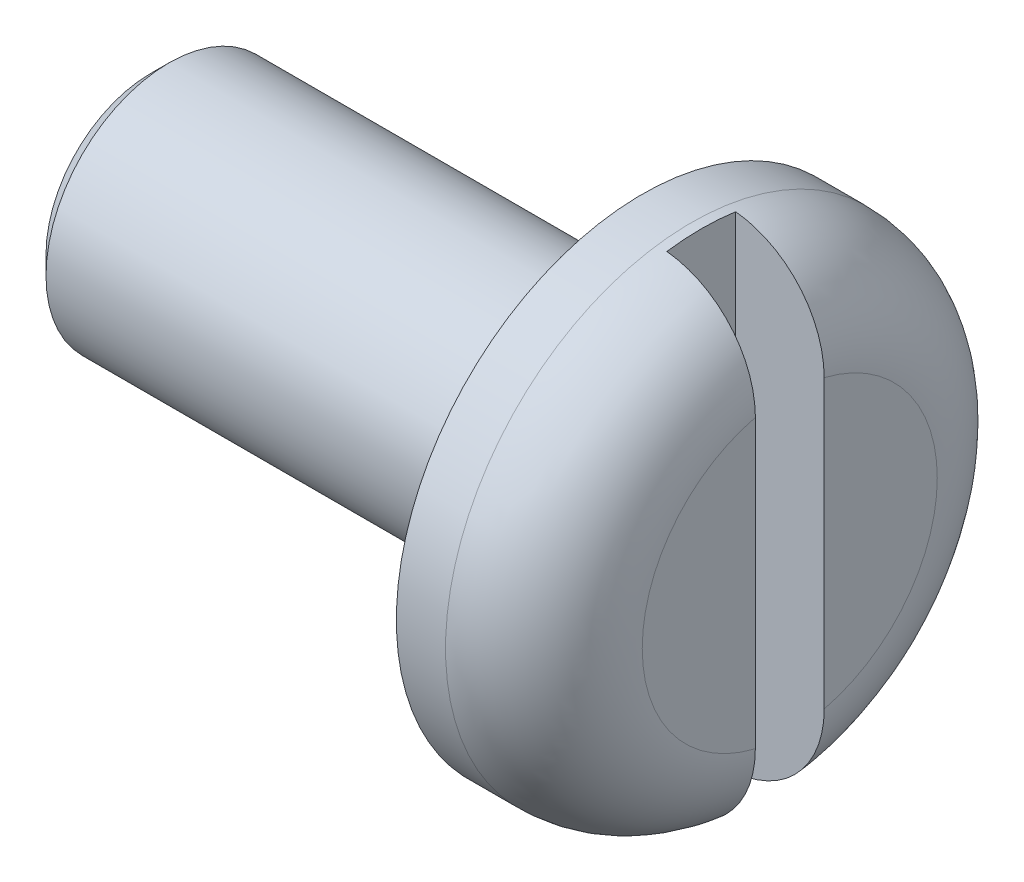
from build123d import *

# Parameters (mm, degrees)
SKETCH1_R           = 10
BOSS_EXTRUDE1_DEPTH = 6
FILLET3_R           = 4
SKETCH2_W           = 2.8
SKETCH2_H           = 22.307895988
CUT_EXTRUDE1_DEPTH  = 3.6
SKETCH3_R           = 5
BOSS_EXTRUDE2_DEPTH = 20
SKETCH4_OUTSIDE_W   = 49.684
SKETCH4_OUTSIDE_H   = 49.684
SKETCH4_OUTSIDE_R   = 4.25
CUT_EXTRUDE3_DEPTH  = 10
CUT_EXTRUDE3_DRAFT  = -45


with BuildPart() as part:
    # Sketch1 → Boss-Extrude1 (new body)
    with BuildSketch(Plane(origin=(0, 0, 0), x_dir=(0, 0, -1), z_dir=(1, 0, 0))):
        Circle(SKETCH1_R)
    extrude(amount=BOSS_EXTRUDE1_DEPTH)

    # Fillet3
    fillet3_edges = [part.edges().sort_by_distance(p)[0] for p in [
        (6, 0, 10),
    ]]
    fillet(fillet3_edges, radius=FILLET3_R)

    # Sketch2 → Cut-Extrude1 (cut)
    with BuildSketch(Plane(origin=(6, 0, 0), x_dir=(0, 0, -1), z_dir=(1, 0, 0))):
        Rectangle(SKETCH2_W, SKETCH2_H)
    extrude(amount=-CUT_EXTRUDE1_DEPTH, mode=Mode.SUBTRACT)

    # Sketch3 → Boss-Extrude2 (add)
    with BuildSketch(Plane.ZY):
        with Locations(Location((0, 0, 0), (0, 0, 180))):
            Circle(SKETCH3_R)
    extrude(amount=BOSS_EXTRUDE2_DEPTH)


with BuildPart() as cut_extrude3_tool:
    # Sketch4 outside → Cut-Extrude3 (with draft: the straight prism first)
    with BuildSketch(Plane.ZY.offset(20)):
        Rectangle(SKETCH4_OUTSIDE_W, SKETCH4_OUTSIDE_H)
        Circle(SKETCH4_OUTSIDE_R, mode=Mode.SUBTRACT)
    extrude(amount=-CUT_EXTRUDE3_DEPTH)
    # Cut-Extrude3: the draft: its side faces are tilted about the plane it starts from
    cut_extrude3_sides = [cut_extrude3_tool.faces().sort_by_distance(p)[0] for p in [
        (-15, -24.842, 0),
        (-15, 0, 24.842),
        (-15, 24.842, 0),
        (-15, 0, -24.842),
        (-15, 0, -4.25),
    ]]
    draft(cut_extrude3_sides, Plane.ZY.offset(20), CUT_EXTRUDE3_DRAFT)


with BuildPart() as part_1:
    add(part.part)

    # Cut-Extrude3: cut by cut_extrude3_tool
    add(cut_extrude3_tool.part, mode=Mode.SUBTRACT)


solid = part_1.part
